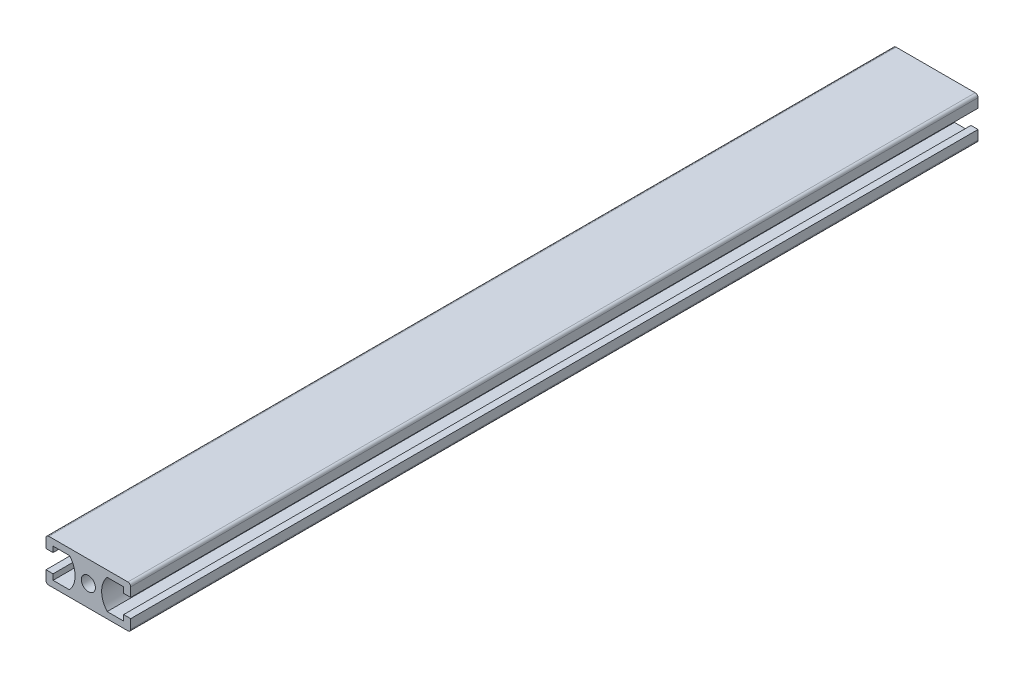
from build123d import *

# Parameters (mm, degrees)
SKETCH_1_R      = 2.5
EXTRUDE_1_DEPTH = 150


with BuildPart() as part:
    # Sketch 1 → Extrude 1 (new, symmetric)
    with BuildSketch(Plane.XY):
        with BuildLine():
            Line((-6.663651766, -5.25), (-12.5, -5.25))
            Line((-12.5, -5.25), (-12.5, -3.25))
            Line((-12.5, -3.25), (-15, -3.25))
            Line((-15, -3.25), (-15, -6.5))
            ThreePointArc((-15, -6.5), (-14.707106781, -7.207106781), (-14, -7.5))
            Line((-14, -7.5), (14, -7.5))
            ThreePointArc((14, -7.5), (14.707106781, -7.207106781), (15, -6.5))
            Line((15, -6.5), (15, -3.25))
            Line((15, -3.25), (12.5, -3.25))
            Line((12.5, -3.25), (12.5, -5.25))
            Line((12.5, -5.25), (6.663651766, -5.25))
            ThreePointArc((6.663651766, -5.25), (4.7, 0), (6.663651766, 5.25))
            Line((6.663651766, 5.25), (12.5, 5.25))
            Line((12.5, 5.25), (12.5, 3.25))
            Line((12.5, 3.25), (15, 3.25))
            Line((15, 3.25), (15, 6.5))
            ThreePointArc((15, 6.5), (14.707106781, 7.207106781), (14, 7.5))
            Line((14, 7.5), (-14, 7.5))
            ThreePointArc((-14, 7.5), (-14.707106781, 7.207106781), (-15, 6.5))
            Line((-15, 6.5), (-15, 3.25))
            Line((-15, 3.25), (-12.5, 3.25))
            Line((-12.5, 3.25), (-12.5, 5.25))
            Line((-12.5, 5.25), (-6.663651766, 5.25))
            ThreePointArc((-6.663651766, 5.25), (-4.7, 0), (-6.663651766, -5.25))
        make_face()
        Circle(SKETCH_1_R, mode=Mode.SUBTRACT)
    extrude(amount=EXTRUDE_1_DEPTH, both=True)


solid = part.part
